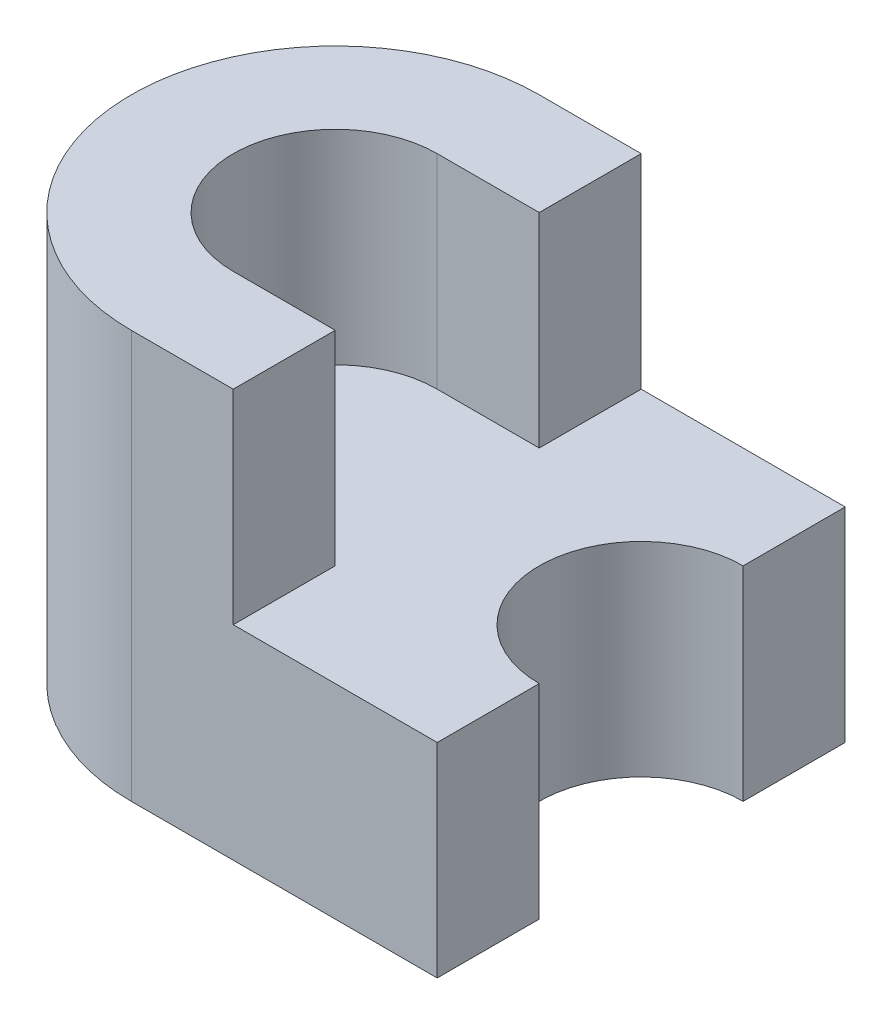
ISO-10303-21;
HEADER;
FILE_DESCRIPTION(('STEP AP214'),'2;1');
FILE_NAME('part.step','',(''),(''),'','','');
FILE_SCHEMA(('AUTOMOTIVE_DESIGN { 1 0 10303 214 1 1 1 1 }'));
ENDSEC;
DATA;
#1=APPLICATION_CONTEXT('core data for automotive mechanical design processes');
#2=APPLICATION_PROTOCOL_DEFINITION('international standard','automotive_design',2000,#1);
#3=PRODUCT_CONTEXT('',#1,'mechanical');
#4=PRODUCT('Part','Part','',(#3));
#5=PRODUCT_RELATED_PRODUCT_CATEGORY('part','',(#4));
#6=PRODUCT_DEFINITION_FORMATION('','',#4);
#7=PRODUCT_DEFINITION_CONTEXT('part definition',#1,'design');
#8=PRODUCT_DEFINITION('design','',#6,#7);
#9=PRODUCT_DEFINITION_SHAPE('','',#8);
#10=(LENGTH_UNIT() NAMED_UNIT(*) SI_UNIT(.MILLI.,.METRE.));
#11=(NAMED_UNIT(*) PLANE_ANGLE_UNIT() SI_UNIT($,.RADIAN.));
#12=(NAMED_UNIT(*) SI_UNIT($,.STERADIAN.) SOLID_ANGLE_UNIT());
#13=UNCERTAINTY_MEASURE_WITH_UNIT(LENGTH_MEASURE(1.E-05),#10,'distance_accuracy_value','');
#14=(GEOMETRIC_REPRESENTATION_CONTEXT(3) GLOBAL_UNCERTAINTY_ASSIGNED_CONTEXT((#13)) GLOBAL_UNIT_ASSIGNED_CONTEXT((#10,
#11,#12)) REPRESENTATION_CONTEXT('',''));
#15=CARTESIAN_POINT('',(0.,0.,0.));
#16=DIRECTION('',(0.,0.,1.));
#17=DIRECTION('',(1.,0.,0.));
#18=AXIS2_PLACEMENT_3D('',#15,#16,#17);
#19=CARTESIAN_POINT('',(30.,20.,-20.));
#20=DIRECTION('',(-1.,0.,0.));
#21=DIRECTION('',(0.,0.,1.));
#22=AXIS2_PLACEMENT_3D('',#19,#20,#21);
#23=PLANE('',#22);
#24=DIRECTION('',(0.,0.,-1.));
#25=VECTOR('',#24,1.);
#26=CARTESIAN_POINT('',(30.,0.,-20.));
#27=LINE('',#26,#25);
#28=CARTESIAN_POINT('',(30.,0.,20.));
#29=VERTEX_POINT('',#28);
#30=CARTESIAN_POINT('',(30.,0.,10.));
#31=VERTEX_POINT('',#30);
#32=EDGE_CURVE('E138',#29,#31,#27,.T.);
#33=ORIENTED_EDGE('',*,*,#32,.T.);
#34=DIRECTION('',(0.,1.,0.));
#35=VECTOR('',#34,1.);
#36=CARTESIAN_POINT('',(30.,0.,10.));
#37=LINE('',#36,#35);
#38=CARTESIAN_POINT('',(30.,20.,10.));
#39=VERTEX_POINT('',#38);
#40=EDGE_CURVE('E45',#31,#39,#37,.T.);
#41=ORIENTED_EDGE('',*,*,#40,.T.);
#42=DIRECTION('',(0.,0.,-1.));
#43=VECTOR('',#42,1.);
#44=CARTESIAN_POINT('',(30.,20.,-20.));
#45=LINE('',#44,#43);
#46=CARTESIAN_POINT('',(30.,20.,20.));
#47=VERTEX_POINT('',#46);
#48=EDGE_CURVE('E167',#47,#39,#45,.T.);
#49=ORIENTED_EDGE('',*,*,#48,.F.);
#50=DIRECTION('',(0.,-1.,0.));
#51=VECTOR('',#50,1.);
#52=CARTESIAN_POINT('',(30.,20.,20.));
#53=LINE('',#52,#51);
#54=EDGE_CURVE('E153',#47,#29,#53,.T.);
#55=ORIENTED_EDGE('',*,*,#54,.T.);
#56=EDGE_LOOP('',(#33,#41,#49,#55));
#57=FACE_BOUND('',#56,.T.);
#58=ADVANCED_FACE('F30',(#57),#23,.F.);
#59=CARTESIAN_POINT('',(0.,20.,0.));
#60=DIRECTION('',(0.,1.,0.));
#61=DIRECTION('',(0.,0.,1.));
#62=AXIS2_PLACEMENT_3D('',#59,#60,#61);
#63=PLANE('',#62);
#64=CARTESIAN_POINT('',(30.,20.,0.));
#65=DIRECTION('',(0.,1.,0.));
#66=DIRECTION('',(0.,0.,1.));
#67=AXIS2_PLACEMENT_3D('',#64,#65,#66);
#68=CIRCLE('',#67,10.);
#69=CARTESIAN_POINT('',(30.,20.,-10.));
#70=VERTEX_POINT('',#69);
#71=EDGE_CURVE('E132',#70,#39,#68,.T.);
#72=ORIENTED_EDGE('',*,*,#71,.F.);
#73=CARTESIAN_POINT('',(30.,20.,-20.));
#74=VERTEX_POINT('',#73);
#75=EDGE_CURVE('E131',#70,#74,#45,.T.);
#76=ORIENTED_EDGE('',*,*,#75,.T.);
#77=DIRECTION('',(-1.,0.,0.));
#78=VECTOR('',#77,1.);
#79=CARTESIAN_POINT('',(0.,20.,-20.));
#80=LINE('',#79,#78);
#81=CARTESIAN_POINT('',(10.,20.,-20.));
#82=VERTEX_POINT('',#81);
#83=EDGE_CURVE('E151',#74,#82,#80,.T.);
#84=ORIENTED_EDGE('',*,*,#83,.T.);
#85=DIRECTION('',(0.,0.,1.));
#86=VECTOR('',#85,1.);
#87=CARTESIAN_POINT('',(10.,20.,-20.));
#88=LINE('',#87,#86);
#89=CARTESIAN_POINT('',(10.,20.,-10.));
#90=VERTEX_POINT('',#89);
#91=EDGE_CURVE('E185',#82,#90,#88,.T.);
#92=ORIENTED_EDGE('',*,*,#91,.T.);
#93=DIRECTION('',(1.,0.,0.));
#94=VECTOR('',#93,1.);
#95=CARTESIAN_POINT('',(0.,20.,-10.));
#96=LINE('',#95,#94);
#97=CARTESIAN_POINT('',(0.,20.,-10.));
#98=VERTEX_POINT('',#97);
#99=EDGE_CURVE('E188',#90,#98,#96,.F.);
#100=ORIENTED_EDGE('',*,*,#99,.T.);
#101=CARTESIAN_POINT('',(0.,20.,0.));
#102=DIRECTION('',(0.,1.,0.));
#103=DIRECTION('',(1.,0.,0.));
#104=AXIS2_PLACEMENT_3D('',#101,#102,#103);
#105=CIRCLE('',#104,10.);
#106=CARTESIAN_POINT('',(0.,20.,10.));
#107=VERTEX_POINT('',#106);
#108=EDGE_CURVE('E196',#98,#107,#105,.T.);
#109=ORIENTED_EDGE('',*,*,#108,.T.);
#110=DIRECTION('',(1.,0.,0.));
#111=VECTOR('',#110,1.);
#112=CARTESIAN_POINT('',(0.,20.,10.));
#113=LINE('',#112,#111);
#114=CARTESIAN_POINT('',(10.,20.,10.));
#115=VERTEX_POINT('',#114);
#116=EDGE_CURVE('E200',#107,#115,#113,.T.);
#117=ORIENTED_EDGE('',*,*,#116,.T.);
#118=DIRECTION('',(0.,0.,1.));
#119=VECTOR('',#118,1.);
#120=CARTESIAN_POINT('',(10.,20.,10.));
#121=LINE('',#120,#119);
#122=CARTESIAN_POINT('',(10.,20.,20.));
#123=VERTEX_POINT('',#122);
#124=EDGE_CURVE('E175',#115,#123,#121,.T.);
#125=ORIENTED_EDGE('',*,*,#124,.T.);
#126=DIRECTION('',(1.,0.,0.));
#127=VECTOR('',#126,1.);
#128=CARTESIAN_POINT('',(30.,20.,20.));
#129=LINE('',#128,#127);
#130=EDGE_CURVE('E146',#123,#47,#129,.T.);
#131=ORIENTED_EDGE('',*,*,#130,.T.);
#132=ORIENTED_EDGE('',*,*,#48,.T.);
#133=EDGE_LOOP('',(#72,#76,#84,#92,#100,#109,#117,#125,#131,#132));
#134=FACE_BOUND('',#133,.T.);
#135=ADVANCED_FACE('F218',(#134),#63,.T.);
#136=CARTESIAN_POINT('',(0.,20.,0.));
#137=DIRECTION('',(0.,-1.,0.));
#138=DIRECTION('',(0.,0.,-1.));
#139=AXIS2_PLACEMENT_3D('',#136,#137,#138);
#140=CYLINDRICAL_SURFACE('',#139,20.);
#141=CARTESIAN_POINT('',(0.,0.,0.));
#142=DIRECTION('',(0.,1.,0.));
#143=DIRECTION('',(0.,0.,1.));
#144=AXIS2_PLACEMENT_3D('',#141,#142,#143);
#145=CIRCLE('',#144,20.);
#146=CARTESIAN_POINT('',(0.,0.,-20.));
#147=VERTEX_POINT('',#146);
#148=CARTESIAN_POINT('',(0.,0.,20.));
#149=VERTEX_POINT('',#148);
#150=EDGE_CURVE('E141',#147,#149,#145,.T.);
#151=ORIENTED_EDGE('',*,*,#150,.T.);
#152=DIRECTION('',(0.,-1.,0.));
#153=VECTOR('',#152,1.);
#154=CARTESIAN_POINT('',(0.,20.,20.));
#155=LINE('',#154,#153);
#156=CARTESIAN_POINT('',(0.,40.,20.));
#157=VERTEX_POINT('',#156);
#158=EDGE_CURVE('E38',#157,#149,#155,.T.);
#159=ORIENTED_EDGE('',*,*,#158,.F.);
#160=CARTESIAN_POINT('',(0.,40.,0.));
#161=DIRECTION('',(0.,1.,0.));
#162=DIRECTION('',(0.,0.,1.));
#163=AXIS2_PLACEMENT_3D('',#160,#161,#162);
#164=CIRCLE('',#163,20.);
#165=CARTESIAN_POINT('',(0.,40.,-20.));
#166=VERTEX_POINT('',#165);
#167=EDGE_CURVE('E182',#166,#157,#164,.T.);
#168=ORIENTED_EDGE('',*,*,#167,.F.);
#169=DIRECTION('',(0.,-1.,0.));
#170=VECTOR('',#169,1.);
#171=CARTESIAN_POINT('',(0.,20.,-20.));
#172=LINE('',#171,#170);
#173=EDGE_CURVE('E147',#166,#147,#172,.T.);
#174=ORIENTED_EDGE('',*,*,#173,.T.);
#175=EDGE_LOOP('',(#151,#159,#168,#174));
#176=FACE_BOUND('',#175,.T.);
#177=ADVANCED_FACE('F32',(#176),#140,.T.);
#178=CARTESIAN_POINT('',(30.,20.,20.));
#179=DIRECTION('',(0.,0.,-1.));
#180=DIRECTION('',(-1.,0.,0.));
#181=AXIS2_PLACEMENT_3D('',#178,#179,#180);
#182=PLANE('',#181);
#183=DIRECTION('',(1.,0.,0.));
#184=VECTOR('',#183,1.);
#185=CARTESIAN_POINT('',(30.,0.,20.));
#186=LINE('',#185,#184);
#187=EDGE_CURVE('E139',#149,#29,#186,.T.);
#188=ORIENTED_EDGE('',*,*,#187,.T.);
#189=ORIENTED_EDGE('',*,*,#54,.F.);
#190=ORIENTED_EDGE('',*,*,#130,.F.);
#191=DIRECTION('',(0.,-1.,0.));
#192=VECTOR('',#191,1.);
#193=CARTESIAN_POINT('',(10.,40.,20.));
#194=LINE('',#193,#192);
#195=CARTESIAN_POINT('',(10.,40.,20.));
#196=VERTEX_POINT('',#195);
#197=EDGE_CURVE('E52',#196,#123,#194,.T.);
#198=ORIENTED_EDGE('',*,*,#197,.F.);
#199=DIRECTION('',(1.,0.,0.));
#200=VECTOR('',#199,1.);
#201=CARTESIAN_POINT('',(0.,40.,20.));
#202=LINE('',#201,#200);
#203=EDGE_CURVE('E187',#157,#196,#202,.T.);
#204=ORIENTED_EDGE('',*,*,#203,.F.);
#205=ORIENTED_EDGE('',*,*,#158,.T.);
#206=EDGE_LOOP('',(#188,#189,#190,#198,#204,#205));
#207=FACE_BOUND('',#206,.T.);
#208=ADVANCED_FACE('F225',(#207),#182,.F.);
#209=ORIENTED_EDGE('',*,*,#75,.F.);
#210=DIRECTION('',(0.,1.,0.));
#211=VECTOR('',#210,1.);
#212=CARTESIAN_POINT('',(30.,0.,-10.));
#213=LINE('',#212,#211);
#214=CARTESIAN_POINT('',(30.,0.,-10.));
#215=VERTEX_POINT('',#214);
#216=EDGE_CURVE('E119',#70,#215,#213,.F.);
#217=ORIENTED_EDGE('',*,*,#216,.T.);
#218=CARTESIAN_POINT('',(30.,0.,-20.));
#219=VERTEX_POINT('',#218);
#220=EDGE_CURVE('E129',#215,#219,#27,.T.);
#221=ORIENTED_EDGE('',*,*,#220,.T.);
#222=DIRECTION('',(0.,-1.,0.));
#223=VECTOR('',#222,1.);
#224=CARTESIAN_POINT('',(30.,20.,-20.));
#225=LINE('',#224,#223);
#226=EDGE_CURVE('E150',#74,#219,#225,.T.);
#227=ORIENTED_EDGE('',*,*,#226,.F.);
#228=EDGE_LOOP('',(#209,#217,#221,#227));
#229=FACE_BOUND('',#228,.T.);
#230=ADVANCED_FACE('F127',(#229),#23,.F.);
#231=CARTESIAN_POINT('',(0.,20.,-20.));
#232=DIRECTION('',(0.,0.,1.));
#233=DIRECTION('',(1.,0.,0.));
#234=AXIS2_PLACEMENT_3D('',#231,#232,#233);
#235=PLANE('',#234);
#236=DIRECTION('',(-1.,0.,0.));
#237=VECTOR('',#236,1.);
#238=CARTESIAN_POINT('',(0.,0.,-20.));
#239=LINE('',#238,#237);
#240=EDGE_CURVE('E137',#219,#147,#239,.T.);
#241=ORIENTED_EDGE('',*,*,#240,.T.);
#242=ORIENTED_EDGE('',*,*,#173,.F.);
#243=DIRECTION('',(-1.,0.,0.));
#244=VECTOR('',#243,1.);
#245=CARTESIAN_POINT('',(0.,40.,-20.));
#246=LINE('',#245,#244);
#247=CARTESIAN_POINT('',(10.,40.,-20.));
#248=VERTEX_POINT('',#247);
#249=EDGE_CURVE('E260',#248,#166,#246,.T.);
#250=ORIENTED_EDGE('',*,*,#249,.F.);
#251=DIRECTION('',(0.,-1.,0.));
#252=VECTOR('',#251,1.);
#253=CARTESIAN_POINT('',(10.,40.,-20.));
#254=LINE('',#253,#252);
#255=EDGE_CURVE('E179',#248,#82,#254,.T.);
#256=ORIENTED_EDGE('',*,*,#255,.T.);
#257=ORIENTED_EDGE('',*,*,#83,.F.);
#258=ORIENTED_EDGE('',*,*,#226,.T.);
#259=EDGE_LOOP('',(#241,#242,#250,#256,#257,#258));
#260=FACE_BOUND('',#259,.T.);
#261=ADVANCED_FACE('F234',(#260),#235,.F.);
#262=CARTESIAN_POINT('',(0.,0.,0.));
#263=DIRECTION('',(0.,1.,0.));
#264=DIRECTION('',(0.,0.,1.));
#265=AXIS2_PLACEMENT_3D('',#262,#263,#264);
#266=PLANE('',#265);
#267=ORIENTED_EDGE('',*,*,#220,.F.);
#268=CARTESIAN_POINT('',(30.,0.,0.));
#269=DIRECTION('',(0.,1.,0.));
#270=DIRECTION('',(0.,0.,1.));
#271=AXIS2_PLACEMENT_3D('',#268,#269,#270);
#272=CIRCLE('',#271,10.);
#273=EDGE_CURVE('E11',#215,#31,#272,.T.);
#274=ORIENTED_EDGE('',*,*,#273,.T.);
#275=ORIENTED_EDGE('',*,*,#32,.F.);
#276=ORIENTED_EDGE('',*,*,#187,.F.);
#277=ORIENTED_EDGE('',*,*,#150,.F.);
#278=ORIENTED_EDGE('',*,*,#240,.F.);
#279=EDGE_LOOP('',(#267,#274,#275,#276,#277,#278));
#280=FACE_BOUND('',#279,.T.);
#281=ADVANCED_FACE('F135',(#280),#266,.F.);
#282=CARTESIAN_POINT('',(10.,40.,10.));
#283=DIRECTION('',(1.,0.,0.));
#284=DIRECTION('',(0.,0.,-1.));
#285=AXIS2_PLACEMENT_3D('',#282,#283,#284);
#286=PLANE('',#285);
#287=ORIENTED_EDGE('',*,*,#124,.F.);
#288=DIRECTION('',(0.,-1.,0.));
#289=VECTOR('',#288,1.);
#290=CARTESIAN_POINT('',(10.,40.,10.));
#291=LINE('',#290,#289);
#292=CARTESIAN_POINT('',(10.,40.,10.));
#293=VERTEX_POINT('',#292);
#294=EDGE_CURVE('E165',#293,#115,#291,.T.);
#295=ORIENTED_EDGE('',*,*,#294,.F.);
#296=DIRECTION('',(0.,0.,1.));
#297=VECTOR('',#296,1.);
#298=CARTESIAN_POINT('',(10.,40.,10.));
#299=LINE('',#298,#297);
#300=EDGE_CURVE('E194',#293,#196,#299,.T.);
#301=ORIENTED_EDGE('',*,*,#300,.T.);
#302=ORIENTED_EDGE('',*,*,#197,.T.);
#303=EDGE_LOOP('',(#287,#295,#301,#302));
#304=FACE_BOUND('',#303,.T.);
#305=ADVANCED_FACE('F230',(#304),#286,.T.);
#306=CARTESIAN_POINT('',(0.,40.,10.));
#307=DIRECTION('',(0.,0.,-1.));
#308=DIRECTION('',(-1.,0.,0.));
#309=AXIS2_PLACEMENT_3D('',#306,#307,#308);
#310=PLANE('',#309);
#311=ORIENTED_EDGE('',*,*,#116,.F.);
#312=DIRECTION('',(0.,-1.,0.));
#313=VECTOR('',#312,1.);
#314=CARTESIAN_POINT('',(0.,40.,10.));
#315=LINE('',#314,#313);
#316=CARTESIAN_POINT('',(0.,40.,10.));
#317=VERTEX_POINT('',#316);
#318=EDGE_CURVE('E173',#317,#107,#315,.T.);
#319=ORIENTED_EDGE('',*,*,#318,.F.);
#320=DIRECTION('',(1.,0.,0.));
#321=VECTOR('',#320,1.);
#322=CARTESIAN_POINT('',(0.,40.,10.));
#323=LINE('',#322,#321);
#324=EDGE_CURVE('E248',#317,#293,#323,.T.);
#325=ORIENTED_EDGE('',*,*,#324,.T.);
#326=ORIENTED_EDGE('',*,*,#294,.T.);
#327=EDGE_LOOP('',(#311,#319,#325,#326));
#328=FACE_BOUND('',#327,.T.);
#329=ADVANCED_FACE('F217',(#328),#310,.T.);
#330=CARTESIAN_POINT('',(0.,40.,0.));
#331=DIRECTION('',(0.,-1.,0.));
#332=DIRECTION('',(0.,0.,-1.));
#333=AXIS2_PLACEMENT_3D('',#330,#331,#332);
#334=CYLINDRICAL_SURFACE('',#333,10.);
#335=ORIENTED_EDGE('',*,*,#108,.F.);
#336=DIRECTION('',(0.,-1.,0.));
#337=VECTOR('',#336,1.);
#338=CARTESIAN_POINT('',(0.,40.,-10.));
#339=LINE('',#338,#337);
#340=CARTESIAN_POINT('',(0.,40.,-10.));
#341=VERTEX_POINT('',#340);
#342=EDGE_CURVE('E205',#341,#98,#339,.T.);
#343=ORIENTED_EDGE('',*,*,#342,.F.);
#344=CARTESIAN_POINT('',(0.,40.,0.));
#345=DIRECTION('',(0.,1.,0.));
#346=DIRECTION('',(1.,0.,0.));
#347=AXIS2_PLACEMENT_3D('',#344,#345,#346);
#348=CIRCLE('',#347,10.);
#349=EDGE_CURVE('E212',#341,#317,#348,.T.);
#350=ORIENTED_EDGE('',*,*,#349,.T.);
#351=ORIENTED_EDGE('',*,*,#318,.T.);
#352=EDGE_LOOP('',(#335,#343,#350,#351));
#353=FACE_BOUND('',#352,.T.);
#354=ADVANCED_FACE('F210',(#353),#334,.F.);
#355=CARTESIAN_POINT('',(0.,40.,-10.));
#356=DIRECTION('',(0.,0.,1.));
#357=DIRECTION('',(1.,0.,0.));
#358=AXIS2_PLACEMENT_3D('',#355,#356,#357);
#359=PLANE('',#358);
#360=ORIENTED_EDGE('',*,*,#99,.F.);
#361=DIRECTION('',(0.,-1.,0.));
#362=VECTOR('',#361,1.);
#363=CARTESIAN_POINT('',(10.,40.,-10.));
#364=LINE('',#363,#362);
#365=CARTESIAN_POINT('',(10.,40.,-10.));
#366=VERTEX_POINT('',#365);
#367=EDGE_CURVE('E181',#366,#90,#364,.T.);
#368=ORIENTED_EDGE('',*,*,#367,.F.);
#369=DIRECTION('',(1.,0.,0.));
#370=VECTOR('',#369,1.);
#371=CARTESIAN_POINT('',(0.,40.,-10.));
#372=LINE('',#371,#370);
#373=EDGE_CURVE('E254',#366,#341,#372,.F.);
#374=ORIENTED_EDGE('',*,*,#373,.T.);
#375=ORIENTED_EDGE('',*,*,#342,.T.);
#376=EDGE_LOOP('',(#360,#368,#374,#375));
#377=FACE_BOUND('',#376,.T.);
#378=ADVANCED_FACE('F274',(#377),#359,.T.);
#379=CARTESIAN_POINT('',(10.,40.,-20.));
#380=DIRECTION('',(1.,0.,0.));
#381=DIRECTION('',(0.,0.,-1.));
#382=AXIS2_PLACEMENT_3D('',#379,#380,#381);
#383=PLANE('',#382);
#384=ORIENTED_EDGE('',*,*,#91,.F.);
#385=ORIENTED_EDGE('',*,*,#255,.F.);
#386=DIRECTION('',(0.,0.,1.));
#387=VECTOR('',#386,1.);
#388=CARTESIAN_POINT('',(10.,40.,-20.));
#389=LINE('',#388,#387);
#390=EDGE_CURVE('E257',#248,#366,#389,.T.);
#391=ORIENTED_EDGE('',*,*,#390,.T.);
#392=ORIENTED_EDGE('',*,*,#367,.T.);
#393=EDGE_LOOP('',(#384,#385,#391,#392));
#394=FACE_BOUND('',#393,.T.);
#395=ADVANCED_FACE('F271',(#394),#383,.T.);
#396=CARTESIAN_POINT('',(0.,40.,0.));
#397=DIRECTION('',(0.,1.,0.));
#398=DIRECTION('',(0.,0.,1.));
#399=AXIS2_PLACEMENT_3D('',#396,#397,#398);
#400=PLANE('',#399);
#401=ORIENTED_EDGE('',*,*,#203,.T.);
#402=ORIENTED_EDGE('',*,*,#300,.F.);
#403=ORIENTED_EDGE('',*,*,#324,.F.);
#404=ORIENTED_EDGE('',*,*,#349,.F.);
#405=ORIENTED_EDGE('',*,*,#373,.F.);
#406=ORIENTED_EDGE('',*,*,#390,.F.);
#407=ORIENTED_EDGE('',*,*,#249,.T.);
#408=ORIENTED_EDGE('',*,*,#167,.T.);
#409=EDGE_LOOP('',(#401,#402,#403,#404,#405,#406,#407,#408));
#410=FACE_BOUND('',#409,.T.);
#411=ADVANCED_FACE('F266',(#410),#400,.T.);
#412=CARTESIAN_POINT('',(30.,0.,0.));
#413=DIRECTION('',(0.,1.,0.));
#414=DIRECTION('',(0.,0.,1.));
#415=AXIS2_PLACEMENT_3D('',#412,#413,#414);
#416=CYLINDRICAL_SURFACE('',#415,10.);
#417=ORIENTED_EDGE('',*,*,#273,.F.);
#418=ORIENTED_EDGE('',*,*,#216,.F.);
#419=ORIENTED_EDGE('',*,*,#71,.T.);
#420=ORIENTED_EDGE('',*,*,#40,.F.);
#421=EDGE_LOOP('',(#417,#418,#419,#420));
#422=FACE_BOUND('',#421,.T.);
#423=ADVANCED_FACE('F118',(#422),#416,.F.);
#424=CLOSED_SHELL('',(#58,#135,#177,#208,#230,#261,#281,#305,#329,#354,#378,#395,#411,#423));
#425=MANIFOLD_SOLID_BREP('B2',#424);
#426=ADVANCED_BREP_SHAPE_REPRESENTATION('',(#18,#425),#14);
#427=SHAPE_DEFINITION_REPRESENTATION(#9,#426);
ENDSEC;
END-ISO-10303-21;
